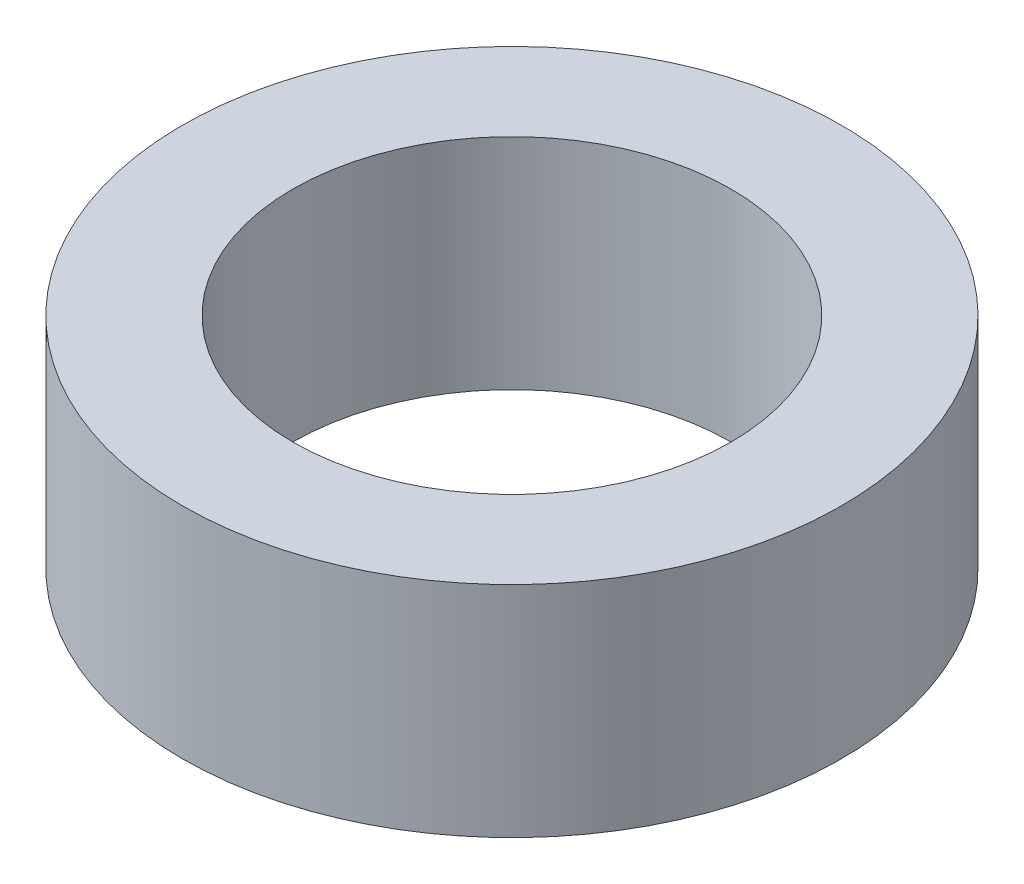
from build123d import *

# Parameters (mm, degrees)
SKETCH1_R      = 2.3876
SKETCH1_R_2    = 1.5875
EXTRUDE1_DEPTH = 0.79375


with BuildPart() as part:
    # Sketch1 → Extrude1 (new, symmetric)
    with BuildSketch(Plane(origin=(0, 0, 0), x_dir=(1, 0, 0), z_dir=(0, 1, 0))):
        with Locations(Location((0, 0, 0), (0, 0, 270))):
            Circle(SKETCH1_R)
        with Locations(Location((0, 0, 0), (0, 0, 270))):
            Circle(SKETCH1_R_2, mode=Mode.SUBTRACT)
    extrude(amount=EXTRUDE1_DEPTH, both=True)


solid = part.part
